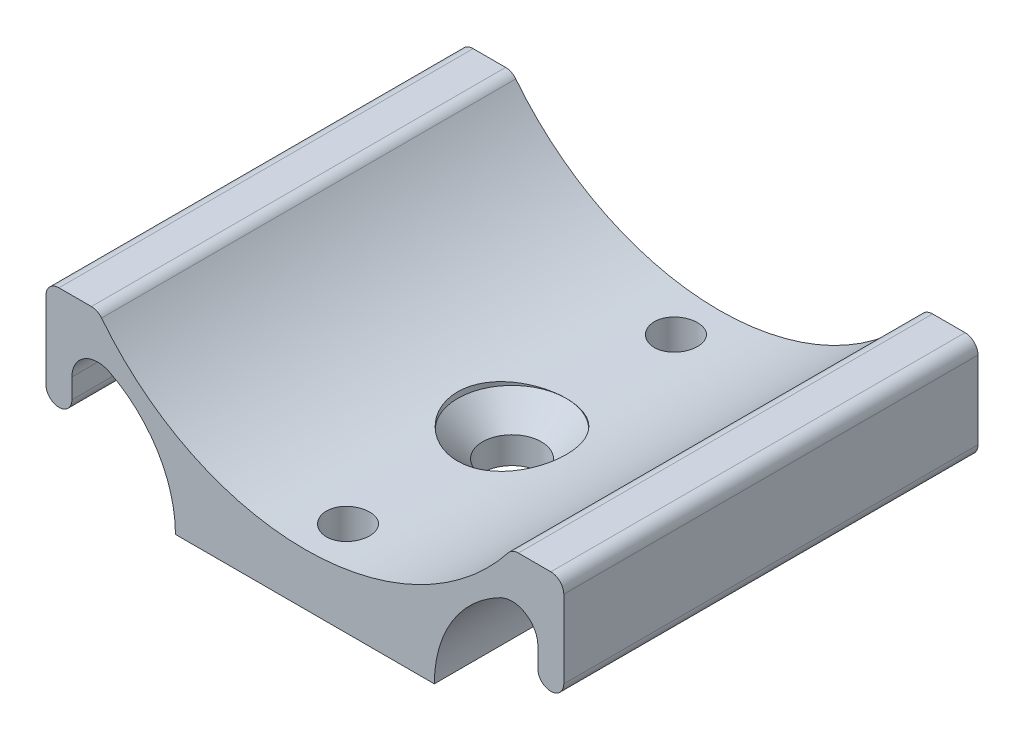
ISO-10303-21;
HEADER;
FILE_DESCRIPTION(('STEP AP214'),'2;1');
FILE_NAME('part.step','',(''),(''),'','','');
FILE_SCHEMA(('AUTOMOTIVE_DESIGN { 1 0 10303 214 1 1 1 1 }'));
ENDSEC;
DATA;
#1=APPLICATION_CONTEXT('core data for automotive mechanical design processes');
#2=APPLICATION_PROTOCOL_DEFINITION('international standard','automotive_design',2000,#1);
#3=PRODUCT_CONTEXT('',#1,'mechanical');
#4=PRODUCT('Part','Part','',(#3));
#5=PRODUCT_RELATED_PRODUCT_CATEGORY('part','',(#4));
#6=PRODUCT_DEFINITION_FORMATION('','',#4);
#7=PRODUCT_DEFINITION_CONTEXT('part definition',#1,'design');
#8=PRODUCT_DEFINITION('design','',#6,#7);
#9=PRODUCT_DEFINITION_SHAPE('','',#8);
#10=(LENGTH_UNIT() NAMED_UNIT(*) SI_UNIT(.MILLI.,.METRE.));
#11=(NAMED_UNIT(*) PLANE_ANGLE_UNIT() SI_UNIT($,.RADIAN.));
#12=(NAMED_UNIT(*) SI_UNIT($,.STERADIAN.) SOLID_ANGLE_UNIT());
#13=UNCERTAINTY_MEASURE_WITH_UNIT(LENGTH_MEASURE(1.E-05),#10,'distance_accuracy_value','');
#14=(GEOMETRIC_REPRESENTATION_CONTEXT(3) GLOBAL_UNCERTAINTY_ASSIGNED_CONTEXT((#13)) GLOBAL_UNIT_ASSIGNED_CONTEXT((#10,
#11,#12)) REPRESENTATION_CONTEXT('',''));
#15=CARTESIAN_POINT('',(0.,0.,0.));
#16=DIRECTION('',(0.,0.,1.));
#17=DIRECTION('',(1.,0.,0.));
#18=AXIS2_PLACEMENT_3D('',#15,#16,#17);
#19=CARTESIAN_POINT('',(14.25,0.75,24.));
#20=DIRECTION('',(0.,0.,-1.));
#21=DIRECTION('',(-1.,0.,0.));
#22=AXIS2_PLACEMENT_3D('',#19,#20,#21);
#23=CYLINDRICAL_SURFACE('',#22,0.750000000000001);
#24=CARTESIAN_POINT('',(14.25,0.75,24.));
#25=DIRECTION('',(0.,0.,-1.));
#26=DIRECTION('',(-1.,0.,0.));
#27=AXIS2_PLACEMENT_3D('',#24,#25,#26);
#28=CIRCLE('',#27,0.750000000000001);
#29=CARTESIAN_POINT('',(13.5,0.75,24.));
#30=VERTEX_POINT('',#29);
#31=CARTESIAN_POINT('',(15.,0.75,24.));
#32=VERTEX_POINT('',#31);
#33=EDGE_CURVE('E401',#30,#32,#28,.F.);
#34=ORIENTED_EDGE('',*,*,#33,.F.);
#35=DIRECTION('',(0.,0.,1.));
#36=VECTOR('',#35,1.);
#37=CARTESIAN_POINT('',(13.5,0.75,12.));
#38=LINE('',#37,#36);
#39=CARTESIAN_POINT('',(13.5,0.75,0.));
#40=VERTEX_POINT('',#39);
#41=EDGE_CURVE('E180',#40,#30,#38,.T.);
#42=ORIENTED_EDGE('',*,*,#41,.F.);
#43=CARTESIAN_POINT('',(14.25,0.75,0.));
#44=DIRECTION('',(0.,0.,-1.));
#45=DIRECTION('',(-1.,0.,0.));
#46=AXIS2_PLACEMENT_3D('',#43,#44,#45);
#47=CIRCLE('',#46,0.750000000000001);
#48=CARTESIAN_POINT('',(15.,0.75,0.));
#49=VERTEX_POINT('',#48);
#50=EDGE_CURVE('E20',#49,#40,#47,.T.);
#51=ORIENTED_EDGE('',*,*,#50,.F.);
#52=DIRECTION('',(0.,0.,-1.));
#53=VECTOR('',#52,1.);
#54=CARTESIAN_POINT('',(15.,0.75,12.));
#55=LINE('',#54,#53);
#56=EDGE_CURVE('E388',#32,#49,#55,.T.);
#57=ORIENTED_EDGE('',*,*,#56,.F.);
#58=EDGE_LOOP('',(#34,#42,#51,#57));
#59=FACE_BOUND('',#58,.T.);
#60=ADVANCED_FACE('F16',(#59),#23,.T.);
#61=CARTESIAN_POINT('',(-14.25,5.25,0.));
#62=DIRECTION('',(0.,0.,1.));
#63=DIRECTION('',(1.,0.,0.));
#64=AXIS2_PLACEMENT_3D('',#61,#62,#63);
#65=CYLINDRICAL_SURFACE('',#64,0.750000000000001);
#66=DIRECTION('',(0.,0.,1.));
#67=VECTOR('',#66,1.);
#68=CARTESIAN_POINT('',(-14.25,6.,12.));
#69=LINE('',#68,#67);
#70=CARTESIAN_POINT('',(-14.25,6.,0.));
#71=VERTEX_POINT('',#70);
#72=CARTESIAN_POINT('',(-14.25,6.,24.));
#73=VERTEX_POINT('',#72);
#74=EDGE_CURVE('E377',#71,#73,#69,.T.);
#75=ORIENTED_EDGE('',*,*,#74,.F.);
#76=CARTESIAN_POINT('',(-14.25,5.25,0.));
#77=DIRECTION('',(0.,0.,1.));
#78=DIRECTION('',(1.,0.,0.));
#79=AXIS2_PLACEMENT_3D('',#76,#77,#78);
#80=CIRCLE('',#79,0.750000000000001);
#81=CARTESIAN_POINT('',(-15.,5.25,0.));
#82=VERTEX_POINT('',#81);
#83=EDGE_CURVE('E403',#82,#71,#80,.F.);
#84=ORIENTED_EDGE('',*,*,#83,.F.);
#85=DIRECTION('',(0.,0.,1.));
#86=VECTOR('',#85,1.);
#87=CARTESIAN_POINT('',(-15.,5.25,12.));
#88=LINE('',#87,#86);
#89=CARTESIAN_POINT('',(-15.,5.25,24.));
#90=VERTEX_POINT('',#89);
#91=EDGE_CURVE('E374',#82,#90,#88,.T.);
#92=ORIENTED_EDGE('',*,*,#91,.T.);
#93=CARTESIAN_POINT('',(-14.25,5.25,24.));
#94=DIRECTION('',(0.,0.,1.));
#95=DIRECTION('',(1.,0.,0.));
#96=AXIS2_PLACEMENT_3D('',#93,#94,#95);
#97=CIRCLE('',#96,0.750000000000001);
#98=EDGE_CURVE('E160',#73,#90,#97,.T.);
#99=ORIENTED_EDGE('',*,*,#98,.F.);
#100=EDGE_LOOP('',(#75,#84,#92,#99));
#101=FACE_BOUND('',#100,.T.);
#102=ADVANCED_FACE('F268',(#101),#65,.T.);
#103=CARTESIAN_POINT('',(-14.25,0.75,24.));
#104=DIRECTION('',(0.,0.,-1.));
#105=DIRECTION('',(-1.,0.,0.));
#106=AXIS2_PLACEMENT_3D('',#103,#104,#105);
#107=CYLINDRICAL_SURFACE('',#106,0.749999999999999);
#108=CARTESIAN_POINT('',(-14.25,0.75,24.));
#109=DIRECTION('',(0.,0.,-1.));
#110=DIRECTION('',(-1.,0.,0.));
#111=AXIS2_PLACEMENT_3D('',#108,#109,#110);
#112=CIRCLE('',#111,0.749999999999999);
#113=CARTESIAN_POINT('',(-15.,0.75,24.));
#114=VERTEX_POINT('',#113);
#115=CARTESIAN_POINT('',(-13.5,0.75,24.));
#116=VERTEX_POINT('',#115);
#117=EDGE_CURVE('E144',#114,#116,#112,.F.);
#118=ORIENTED_EDGE('',*,*,#117,.F.);
#119=DIRECTION('',(0.,0.,-1.));
#120=VECTOR('',#119,1.);
#121=CARTESIAN_POINT('',(-15.,0.75,12.));
#122=LINE('',#121,#120);
#123=CARTESIAN_POINT('',(-15.,0.75,0.));
#124=VERTEX_POINT('',#123);
#125=EDGE_CURVE('E155',#114,#124,#122,.T.);
#126=ORIENTED_EDGE('',*,*,#125,.T.);
#127=CARTESIAN_POINT('',(-14.25,0.75,0.));
#128=DIRECTION('',(0.,0.,-1.));
#129=DIRECTION('',(-1.,0.,0.));
#130=AXIS2_PLACEMENT_3D('',#127,#128,#129);
#131=CIRCLE('',#130,0.749999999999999);
#132=CARTESIAN_POINT('',(-13.5,0.75,0.));
#133=VERTEX_POINT('',#132);
#134=EDGE_CURVE('E150',#133,#124,#131,.T.);
#135=ORIENTED_EDGE('',*,*,#134,.F.);
#136=DIRECTION('',(0.,0.,1.));
#137=VECTOR('',#136,1.);
#138=CARTESIAN_POINT('',(-13.5,0.75,12.));
#139=LINE('',#138,#137);
#140=EDGE_CURVE('E153',#133,#116,#139,.T.);
#141=ORIENTED_EDGE('',*,*,#140,.T.);
#142=EDGE_LOOP('',(#118,#126,#135,#141));
#143=FACE_BOUND('',#142,.T.);
#144=ADVANCED_FACE('F152',(#143),#107,.T.);
#145=CARTESIAN_POINT('',(-13.5,0.75,0.));
#146=DIRECTION('',(-1.,0.,0.));
#147=DIRECTION('',(0.,0.,1.));
#148=AXIS2_PLACEMENT_3D('',#145,#146,#147);
#149=PLANE('',#148);
#150=DIRECTION('',(0.,0.,1.));
#151=VECTOR('',#150,1.);
#152=CARTESIAN_POINT('',(-13.5,1.898979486,12.));
#153=LINE('',#152,#151);
#154=CARTESIAN_POINT('',(-13.5,1.898979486,24.));
#155=VERTEX_POINT('',#154);
#156=CARTESIAN_POINT('',(-13.5,1.898979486,0.));
#157=VERTEX_POINT('',#156);
#158=EDGE_CURVE('E369',#155,#157,#153,.F.);
#159=ORIENTED_EDGE('',*,*,#158,.F.);
#160=DIRECTION('',(0.,1.,0.));
#161=VECTOR('',#160,1.);
#162=CARTESIAN_POINT('',(-13.5,1.324489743,24.));
#163=LINE('',#162,#161);
#164=EDGE_CURVE('E167',#116,#155,#163,.T.);
#165=ORIENTED_EDGE('',*,*,#164,.F.);
#166=ORIENTED_EDGE('',*,*,#140,.F.);
#167=DIRECTION('',(0.,-1.,0.));
#168=VECTOR('',#167,1.);
#169=CARTESIAN_POINT('',(-13.5,1.324489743,0.));
#170=LINE('',#169,#168);
#171=EDGE_CURVE('E165',#157,#133,#170,.T.);
#172=ORIENTED_EDGE('',*,*,#171,.F.);
#173=EDGE_LOOP('',(#159,#165,#166,#172));
#174=FACE_BOUND('',#173,.T.);
#175=ADVANCED_FACE('F164',(#174),#149,.F.);
#176=CARTESIAN_POINT('',(13.5,0.75,0.));
#177=DIRECTION('',(-1.,0.,0.));
#178=DIRECTION('',(0.,0.,1.));
#179=AXIS2_PLACEMENT_3D('',#176,#177,#178);
#180=PLANE('',#179);
#181=DIRECTION('',(0.,-1.,0.));
#182=VECTOR('',#181,1.);
#183=CARTESIAN_POINT('',(13.5,1.324489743,0.));
#184=LINE('',#183,#182);
#185=CARTESIAN_POINT('',(13.5,1.89897948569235,0.));
#186=VERTEX_POINT('',#185);
#187=EDGE_CURVE('E176',#186,#40,#184,.T.);
#188=ORIENTED_EDGE('',*,*,#187,.T.);
#189=ORIENTED_EDGE('',*,*,#41,.T.);
#190=DIRECTION('',(0.,1.,0.));
#191=VECTOR('',#190,1.);
#192=CARTESIAN_POINT('',(13.5,1.324489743,24.));
#193=LINE('',#192,#191);
#194=CARTESIAN_POINT('',(13.5,1.89897948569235,24.));
#195=VERTEX_POINT('',#194);
#196=EDGE_CURVE('E174',#30,#195,#193,.T.);
#197=ORIENTED_EDGE('',*,*,#196,.T.);
#198=DIRECTION('',(0.,0.,-1.));
#199=VECTOR('',#198,1.);
#200=CARTESIAN_POINT('',(13.5,1.89897948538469,12.));
#201=LINE('',#200,#199);
#202=EDGE_CURVE('E365',#186,#195,#201,.F.);
#203=ORIENTED_EDGE('',*,*,#202,.F.);
#204=EDGE_LOOP('',(#188,#189,#197,#203));
#205=FACE_BOUND('',#204,.T.);
#206=ADVANCED_FACE('F264',(#205),#180,.T.);
#207=CARTESIAN_POINT('',(14.25,5.25,24.));
#208=DIRECTION('',(0.,0.,-1.));
#209=DIRECTION('',(-1.,0.,0.));
#210=AXIS2_PLACEMENT_3D('',#207,#208,#209);
#211=CYLINDRICAL_SURFACE('',#210,0.750000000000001);
#212=DIRECTION('',(0.,0.,1.));
#213=VECTOR('',#212,1.);
#214=CARTESIAN_POINT('',(15.,5.25,12.));
#215=LINE('',#214,#213);
#216=CARTESIAN_POINT('',(15.,5.25,0.));
#217=VERTEX_POINT('',#216);
#218=CARTESIAN_POINT('',(15.,5.25,24.));
#219=VERTEX_POINT('',#218);
#220=EDGE_CURVE('E381',#217,#219,#215,.T.);
#221=ORIENTED_EDGE('',*,*,#220,.F.);
#222=CARTESIAN_POINT('',(14.25,5.25,0.));
#223=DIRECTION('',(0.,0.,-1.));
#224=DIRECTION('',(-1.,0.,0.));
#225=AXIS2_PLACEMENT_3D('',#222,#223,#224);
#226=CIRCLE('',#225,0.750000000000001);
#227=CARTESIAN_POINT('',(14.25,6.,0.));
#228=VERTEX_POINT('',#227);
#229=EDGE_CURVE('E182',#228,#217,#226,.T.);
#230=ORIENTED_EDGE('',*,*,#229,.F.);
#231=DIRECTION('',(0.,0.,-1.));
#232=VECTOR('',#231,1.);
#233=CARTESIAN_POINT('',(14.25,6.,12.));
#234=LINE('',#233,#232);
#235=CARTESIAN_POINT('',(14.25,6.,24.));
#236=VERTEX_POINT('',#235);
#237=EDGE_CURVE('E368',#236,#228,#234,.T.);
#238=ORIENTED_EDGE('',*,*,#237,.F.);
#239=CARTESIAN_POINT('',(14.25,5.25,24.));
#240=DIRECTION('',(0.,0.,-1.));
#241=DIRECTION('',(-1.,0.,0.));
#242=AXIS2_PLACEMENT_3D('',#239,#240,#241);
#243=CIRCLE('',#242,0.750000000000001);
#244=EDGE_CURVE('E391',#219,#236,#243,.F.);
#245=ORIENTED_EDGE('',*,*,#244,.F.);
#246=EDGE_LOOP('',(#221,#230,#238,#245));
#247=FACE_BOUND('',#246,.T.);
#248=ADVANCED_FACE('F260',(#247),#211,.T.);
#249=CARTESIAN_POINT('',(15.,0.75,24.));
#250=DIRECTION('',(1.,0.,0.));
#251=DIRECTION('',(0.,0.,-1.));
#252=AXIS2_PLACEMENT_3D('',#249,#250,#251);
#253=PLANE('',#252);
#254=DIRECTION('',(0.,1.,0.));
#255=VECTOR('',#254,1.);
#256=CARTESIAN_POINT('',(15.,1.5,0.));
#257=LINE('',#256,#255);
#258=EDGE_CURVE('E343',#49,#217,#257,.T.);
#259=ORIENTED_EDGE('',*,*,#258,.T.);
#260=ORIENTED_EDGE('',*,*,#220,.T.);
#261=DIRECTION('',(0.,1.,0.));
#262=VECTOR('',#261,1.);
#263=CARTESIAN_POINT('',(15.,1.5,24.));
#264=LINE('',#263,#262);
#265=EDGE_CURVE('E329',#32,#219,#264,.T.);
#266=ORIENTED_EDGE('',*,*,#265,.F.);
#267=ORIENTED_EDGE('',*,*,#56,.T.);
#268=EDGE_LOOP('',(#259,#260,#266,#267));
#269=FACE_BOUND('',#268,.T.);
#270=ADVANCED_FACE('F263',(#269),#253,.T.);
#271=CARTESIAN_POINT('',(-14.25,6.,0.));
#272=DIRECTION('',(0.,1.,0.));
#273=DIRECTION('',(0.,0.,1.));
#274=AXIS2_PLACEMENT_3D('',#271,#272,#273);
#275=PLANE('',#274);
#276=DIRECTION('',(-1.,0.,0.));
#277=VECTOR('',#276,1.);
#278=CARTESIAN_POINT('',(0.,6.,0.));
#279=LINE('',#278,#277);
#280=CARTESIAN_POINT('',(-12.3693168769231,6.,0.));
#281=VERTEX_POINT('',#280);
#282=EDGE_CURVE('E338',#281,#71,#279,.T.);
#283=ORIENTED_EDGE('',*,*,#282,.T.);
#284=ORIENTED_EDGE('',*,*,#74,.T.);
#285=DIRECTION('',(-1.,0.,0.));
#286=VECTOR('',#285,1.);
#287=CARTESIAN_POINT('',(0.,6.,24.));
#288=LINE('',#287,#286);
#289=CARTESIAN_POINT('',(-12.3693168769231,6.,24.));
#290=VERTEX_POINT('',#289);
#291=EDGE_CURVE('E323',#290,#73,#288,.T.);
#292=ORIENTED_EDGE('',*,*,#291,.F.);
#293=DIRECTION('',(0.,0.,1.));
#294=VECTOR('',#293,1.);
#295=CARTESIAN_POINT('',(-12.3693168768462,6.,12.));
#296=LINE('',#295,#294);
#297=EDGE_CURVE('E382',#290,#281,#296,.F.);
#298=ORIENTED_EDGE('',*,*,#297,.T.);
#299=EDGE_LOOP('',(#283,#284,#292,#298));
#300=FACE_BOUND('',#299,.T.);
#301=ADVANCED_FACE('F282',(#300),#275,.T.);
#302=CARTESIAN_POINT('',(-15.,0.75,24.));
#303=DIRECTION('',(1.,0.,0.));
#304=DIRECTION('',(0.,0.,-1.));
#305=AXIS2_PLACEMENT_3D('',#302,#303,#304);
#306=PLANE('',#305);
#307=ORIENTED_EDGE('',*,*,#125,.F.);
#308=DIRECTION('',(0.,-1.,0.));
#309=VECTOR('',#308,1.);
#310=CARTESIAN_POINT('',(-15.,1.5,24.));
#311=LINE('',#310,#309);
#312=EDGE_CURVE('E320',#90,#114,#311,.T.);
#313=ORIENTED_EDGE('',*,*,#312,.F.);
#314=ORIENTED_EDGE('',*,*,#91,.F.);
#315=DIRECTION('',(0.,-1.,0.));
#316=VECTOR('',#315,1.);
#317=CARTESIAN_POINT('',(-15.,1.5,0.));
#318=LINE('',#317,#316);
#319=EDGE_CURVE('E336',#82,#124,#318,.T.);
#320=ORIENTED_EDGE('',*,*,#319,.T.);
#321=EDGE_LOOP('',(#307,#313,#314,#320));
#322=FACE_BOUND('',#321,.T.);
#323=ADVANCED_FACE('F258',(#322),#306,.F.);
#324=CARTESIAN_POINT('',(-12.,1.898979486,24.));
#325=DIRECTION('',(0.,0.,-1.));
#326=DIRECTION('',(-1.,0.,0.));
#327=AXIS2_PLACEMENT_3D('',#324,#325,#326);
#328=CYLINDRICAL_SURFACE('',#327,1.5);
#329=CARTESIAN_POINT('',(-12.,1.898979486,0.));
#330=DIRECTION('',(0.,0.,-1.));
#331=DIRECTION('',(-1.,0.,0.));
#332=AXIS2_PLACEMENT_3D('',#329,#330,#331);
#333=CIRCLE('',#332,1.5);
#334=CARTESIAN_POINT('',(-11.3181818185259,3.23506479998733,0.));
#335=VERTEX_POINT('',#334);
#336=EDGE_CURVE('E173',#157,#335,#333,.T.);
#337=ORIENTED_EDGE('',*,*,#336,.T.);
#338=DIRECTION('',(0.,0.,1.));
#339=VECTOR('',#338,1.);
#340=CARTESIAN_POINT('',(-11.3181818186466,3.2350648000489,12.));
#341=LINE('',#340,#339);
#342=CARTESIAN_POINT('',(-11.3181818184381,3.23506480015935,24.));
#343=VERTEX_POINT('',#342);
#344=EDGE_CURVE('E371',#343,#335,#341,.F.);
#345=ORIENTED_EDGE('',*,*,#344,.F.);
#346=CARTESIAN_POINT('',(-12.,1.898979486,24.));
#347=DIRECTION('',(0.,0.,-1.));
#348=DIRECTION('',(-1.,0.,0.));
#349=AXIS2_PLACEMENT_3D('',#346,#347,#348);
#350=CIRCLE('',#349,1.5);
#351=EDGE_CURVE('E322',#155,#343,#350,.T.);
#352=ORIENTED_EDGE('',*,*,#351,.F.);
#353=ORIENTED_EDGE('',*,*,#158,.T.);
#354=EDGE_LOOP('',(#337,#345,#352,#353));
#355=FACE_BOUND('',#354,.T.);
#356=ADVANCED_FACE('F254',(#355),#328,.F.);
#357=CARTESIAN_POINT('',(12.,1.898979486,24.));
#358=DIRECTION('',(0.,0.,-1.));
#359=DIRECTION('',(-1.,0.,0.));
#360=AXIS2_PLACEMENT_3D('',#357,#358,#359);
#361=CYLINDRICAL_SURFACE('',#360,1.5);
#362=CARTESIAN_POINT('',(12.,1.898979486,0.));
#363=DIRECTION('',(0.,0.,-1.));
#364=DIRECTION('',(-1.,0.,0.));
#365=AXIS2_PLACEMENT_3D('',#362,#363,#364);
#366=CIRCLE('',#365,1.5);
#367=CARTESIAN_POINT('',(11.318181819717,3.23506480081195,0.));
#368=VERTEX_POINT('',#367);
#369=EDGE_CURVE('E385',#368,#186,#366,.T.);
#370=ORIENTED_EDGE('',*,*,#369,.T.);
#371=ORIENTED_EDGE('',*,*,#202,.T.);
#372=CARTESIAN_POINT('',(12.,1.898979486,24.));
#373=DIRECTION('',(0.,0.,-1.));
#374=DIRECTION('',(-1.,0.,0.));
#375=AXIS2_PLACEMENT_3D('',#372,#373,#374);
#376=CIRCLE('',#375,1.5);
#377=CARTESIAN_POINT('',(11.3181818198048,3.23506480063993,24.));
#378=VERTEX_POINT('',#377);
#379=EDGE_CURVE('E427',#378,#195,#376,.T.);
#380=ORIENTED_EDGE('',*,*,#379,.F.);
#381=DIRECTION('',(0.,0.,-1.));
#382=VECTOR('',#381,1.);
#383=CARTESIAN_POINT('',(11.3181818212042,3.2350648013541,12.));
#384=LINE('',#383,#382);
#385=EDGE_CURVE('E346',#368,#378,#384,.F.);
#386=ORIENTED_EDGE('',*,*,#385,.F.);
#387=EDGE_LOOP('',(#370,#371,#380,#386));
#388=FACE_BOUND('',#387,.T.);
#389=ADVANCED_FACE('F251',(#388),#361,.F.);
#390=CARTESIAN_POINT('',(12.369316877,6.,0.));
#391=DIRECTION('',(0.,1.,0.));
#392=DIRECTION('',(0.,0.,1.));
#393=AXIS2_PLACEMENT_3D('',#390,#391,#392);
#394=PLANE('',#393);
#395=DIRECTION('',(-1.,0.,0.));
#396=VECTOR('',#395,1.);
#397=CARTESIAN_POINT('',(0.,6.,0.));
#398=LINE('',#397,#396);
#399=CARTESIAN_POINT('',(12.3693168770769,6.,0.));
#400=VERTEX_POINT('',#399);
#401=EDGE_CURVE('E341',#228,#400,#398,.T.);
#402=ORIENTED_EDGE('',*,*,#401,.T.);
#403=DIRECTION('',(0.,0.,-1.));
#404=VECTOR('',#403,1.);
#405=CARTESIAN_POINT('',(12.3693168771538,6.,12.));
#406=LINE('',#405,#404);
#407=CARTESIAN_POINT('',(12.3693168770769,6.,24.));
#408=VERTEX_POINT('',#407);
#409=EDGE_CURVE('E361',#400,#408,#406,.F.);
#410=ORIENTED_EDGE('',*,*,#409,.T.);
#411=DIRECTION('',(-1.,0.,0.));
#412=VECTOR('',#411,1.);
#413=CARTESIAN_POINT('',(0.,6.,24.));
#414=LINE('',#413,#412);
#415=EDGE_CURVE('E327',#236,#408,#414,.T.);
#416=ORIENTED_EDGE('',*,*,#415,.F.);
#417=ORIENTED_EDGE('',*,*,#237,.T.);
#418=EDGE_LOOP('',(#402,#410,#416,#417));
#419=FACE_BOUND('',#418,.T.);
#420=ADVANCED_FACE('F249',(#419),#394,.T.);
#421=CARTESIAN_POINT('',(-14.5,-3.,24.));
#422=DIRECTION('',(0.,0.,-1.));
#423=DIRECTION('',(-1.,0.,0.));
#424=AXIS2_PLACEMENT_3D('',#421,#422,#423);
#425=CYLINDRICAL_SURFACE('',#424,7.);
#426=CARTESIAN_POINT('',(-14.5,-3.,0.));
#427=DIRECTION('',(0.,0.,-1.));
#428=DIRECTION('',(-1.,0.,0.));
#429=AXIS2_PLACEMENT_3D('',#426,#427,#428);
#430=CIRCLE('',#429,7.);
#431=CARTESIAN_POINT('',(-7.5,-3.,0.));
#432=VERTEX_POINT('',#431);
#433=EDGE_CURVE('E411',#335,#432,#430,.T.);
#434=ORIENTED_EDGE('',*,*,#433,.T.);
#435=DIRECTION('',(0.,0.,1.));
#436=VECTOR('',#435,1.);
#437=CARTESIAN_POINT('',(-7.5,-3.,12.));
#438=LINE('',#437,#436);
#439=CARTESIAN_POINT('',(-7.5,-3.,24.));
#440=VERTEX_POINT('',#439);
#441=EDGE_CURVE('E355',#432,#440,#438,.T.);
#442=ORIENTED_EDGE('',*,*,#441,.T.);
#443=CARTESIAN_POINT('',(-14.5,-3.,24.));
#444=DIRECTION('',(0.,0.,-1.));
#445=DIRECTION('',(-1.,0.,0.));
#446=AXIS2_PLACEMENT_3D('',#443,#444,#445);
#447=CIRCLE('',#446,7.);
#448=EDGE_CURVE('E423',#343,#440,#447,.T.);
#449=ORIENTED_EDGE('',*,*,#448,.F.);
#450=ORIENTED_EDGE('',*,*,#344,.T.);
#451=EDGE_LOOP('',(#434,#442,#449,#450));
#452=FACE_BOUND('',#451,.T.);
#453=ADVANCED_FACE('F245',(#452),#425,.F.);
#454=CARTESIAN_POINT('',(14.5,-3.,24.));
#455=DIRECTION('',(0.,0.,-1.));
#456=DIRECTION('',(-1.,0.,0.));
#457=AXIS2_PLACEMENT_3D('',#454,#455,#456);
#458=CYLINDRICAL_SURFACE('',#457,7.);
#459=CARTESIAN_POINT('',(14.5,-3.,24.));
#460=DIRECTION('',(0.,0.,-1.));
#461=DIRECTION('',(-1.,0.,0.));
#462=AXIS2_PLACEMENT_3D('',#459,#460,#461);
#463=CIRCLE('',#462,7.);
#464=CARTESIAN_POINT('',(7.5,-3.,24.));
#465=VERTEX_POINT('',#464);
#466=EDGE_CURVE('E425',#465,#378,#463,.T.);
#467=ORIENTED_EDGE('',*,*,#466,.F.);
#468=DIRECTION('',(0.,0.,-1.));
#469=VECTOR('',#468,1.);
#470=CARTESIAN_POINT('',(7.5,-3.,12.));
#471=LINE('',#470,#469);
#472=CARTESIAN_POINT('',(7.5,-3.,0.));
#473=VERTEX_POINT('',#472);
#474=EDGE_CURVE('E347',#465,#473,#471,.T.);
#475=ORIENTED_EDGE('',*,*,#474,.T.);
#476=CARTESIAN_POINT('',(14.5,-3.,0.));
#477=DIRECTION('',(0.,0.,-1.));
#478=DIRECTION('',(-1.,0.,0.));
#479=AXIS2_PLACEMENT_3D('',#476,#477,#478);
#480=CIRCLE('',#479,7.);
#481=EDGE_CURVE('E414',#473,#368,#480,.T.);
#482=ORIENTED_EDGE('',*,*,#481,.T.);
#483=ORIENTED_EDGE('',*,*,#385,.T.);
#484=EDGE_LOOP('',(#467,#475,#482,#483));
#485=FACE_BOUND('',#484,.T.);
#486=ADVANCED_FACE('F241',(#485),#458,.F.);
#487=CARTESIAN_POINT('',(0.,0.0704948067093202,21.5));
#488=DIRECTION('',(0.,-1.,0.));
#489=DIRECTION('',(0.,0.,-1.));
#490=AXIS2_PLACEMENT_3D('',#487,#488,#489);
#491=CYLINDRICAL_SURFACE('',#490,1.25);
#492=CARTESIAN_POINT('',(3.46220824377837E-09,0.,20.25));
#493=CARTESIAN_POINT('',(0.0700217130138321,6.42643320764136E-07,20.2500029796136));
#494=CARTESIAN_POINT('',(0.140136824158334,0.000495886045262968,20.255907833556));
#495=CARTESIAN_POINT('',(0.278473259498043,0.00242482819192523,20.2793881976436));
#496=CARTESIAN_POINT('',(0.346690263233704,0.00386051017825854,20.2969883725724));
#497=CARTESIAN_POINT('',(0.479138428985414,0.0075081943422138,20.3433491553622));
#498=CARTESIAN_POINT('',(0.543373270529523,0.00971946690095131,20.3720992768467));
#499=CARTESIAN_POINT('',(0.666073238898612,0.0146697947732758,20.4399246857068));
#500=CARTESIAN_POINT('',(0.724540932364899,0.0174086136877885,20.4789953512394));
#501=CARTESIAN_POINT('',(0.834236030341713,0.0231151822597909,20.5664677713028));
#502=CARTESIAN_POINT('',(0.885446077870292,0.0260834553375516,20.6148912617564));
#503=CARTESIAN_POINT('',(0.979024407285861,0.0319101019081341,20.7196509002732));
#504=CARTESIAN_POINT('',(1.02139187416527,0.0347684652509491,20.7759877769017));
#505=CARTESIAN_POINT('',(1.09613505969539,0.0400568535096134,20.8950729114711));
#506=CARTESIAN_POINT('',(1.12849632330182,0.0424862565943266,20.9578302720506));
#507=CARTESIAN_POINT('',(1.18221573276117,0.0466359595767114,21.0879109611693));
#508=CARTESIAN_POINT('',(1.20357416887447,0.0483562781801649,21.155234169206));
#509=CARTESIAN_POINT('',(1.23463377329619,0.0508888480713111,21.2923691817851));
#510=CARTESIAN_POINT('',(1.24436206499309,0.0517032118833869,21.3621748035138));
#511=CARTESIAN_POINT('',(1.25196901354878,0.052338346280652,21.5024326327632));
#512=CARTESIAN_POINT('',(1.24984787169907,0.052159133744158,21.57288482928));
#513=CARTESIAN_POINT('',(1.2338386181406,0.0508292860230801,21.7122492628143));
#514=CARTESIAN_POINT('',(1.21998009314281,0.0496810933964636,21.7811649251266));
#515=CARTESIAN_POINT('',(1.1809352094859,0.0465464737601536,21.9156892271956));
#516=CARTESIAN_POINT('',(1.15574863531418,0.0445600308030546,21.9812978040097));
#517=CARTESIAN_POINT('',(1.09472847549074,0.0399698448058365,22.1074412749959));
#518=CARTESIAN_POINT('',(1.05888124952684,0.0373653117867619,22.1679695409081));
#519=CARTESIAN_POINT('',(0.977570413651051,0.0318334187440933,22.2821561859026));
#520=CARTESIAN_POINT('',(0.932107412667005,0.0289060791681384,22.335814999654));
#521=CARTESIAN_POINT('',(0.832698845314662,0.0230479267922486,22.434907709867));
#522=CARTESIAN_POINT('',(0.778729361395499,0.0201171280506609,22.4803176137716));
#523=CARTESIAN_POINT('',(0.663890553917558,0.0145888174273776,22.5614580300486));
#524=CARTESIAN_POINT('',(0.603018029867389,0.0119914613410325,22.5971840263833));
#525=CARTESIAN_POINT('',(0.476069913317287,0.00742199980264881,22.6579366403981));
#526=CARTESIAN_POINT('',(0.409989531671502,0.00545047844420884,22.6829532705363));
#527=CARTESIAN_POINT('',(0.274637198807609,0.00236243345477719,22.7214772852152));
#528=CARTESIAN_POINT('',(0.205372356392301,0.00124409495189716,22.7350091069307));
#529=CARTESIAN_POINT('',(0.113043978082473,0.000408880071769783,22.7450848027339));
#530=CARTESIAN_POINT('',(0.090477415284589,0.000255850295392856,22.7469266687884));
#531=CARTESIAN_POINT('',(0.0452771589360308,5.13063506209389E-05,22.7493847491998));
#532=CARTESIAN_POINT('',(0.022643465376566,-2.07804480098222E-07,22.7500009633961));
#533=CARTESIAN_POINT('',(-0.0700217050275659,6.4260604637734E-07,22.7499970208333));
#534=CARTESIAN_POINT('',(-0.140136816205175,0.000495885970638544,22.7440921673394));
#535=CARTESIAN_POINT('',(-0.278473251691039,0.00242482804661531,22.7206118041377));
#536=CARTESIAN_POINT('',(-0.346690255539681,0.00386050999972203,22.703011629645));
#537=CARTESIAN_POINT('',(-0.479138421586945,0.00750819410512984,22.6566508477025));
#538=CARTESIAN_POINT('',(-0.543373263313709,0.00971946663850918,22.6279007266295));
#539=CARTESIAN_POINT('',(-0.666073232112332,0.0146697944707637,22.560075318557));
#540=CARTESIAN_POINT('',(-0.724540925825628,0.0174086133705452,22.5210046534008));
#541=CARTESIAN_POINT('',(-0.83423602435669,0.0231151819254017,22.4335322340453));
#542=CARTESIAN_POINT('',(-0.885446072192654,0.0260834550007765,22.385108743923));
#543=CARTESIAN_POINT('',(-0.979024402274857,0.0319101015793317,22.2803491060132));
#544=CARTESIAN_POINT('',(-1.02139186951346,0.0347684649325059,22.2240122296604));
#545=CARTESIAN_POINT('',(-1.09613505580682,0.0400568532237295,22.1049270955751));
#546=CARTESIAN_POINT('',(-1.12849631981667,0.0424862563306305,22.0421697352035));
#547=CARTESIAN_POINT('',(-1.18221573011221,0.0466359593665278,21.9120890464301));
#548=CARTESIAN_POINT('',(-1.20357416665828,0.0483562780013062,21.8447658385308));
#549=CARTESIAN_POINT('',(-1.2346337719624,0.0508888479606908,21.7076308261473));
#550=CARTESIAN_POINT('',(-1.24436206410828,0.0517032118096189,21.637825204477));
#551=CARTESIAN_POINT('',(-1.25196901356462,0.0523383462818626,21.4975673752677));
#552=CARTESIAN_POINT('',(-1.2498478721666,0.0521591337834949,21.4271151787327));
#553=CARTESIAN_POINT('',(-1.23383861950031,0.0508292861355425,21.2877507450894));
#554=CARTESIAN_POINT('',(-1.21998009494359,0.0496810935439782,21.2188350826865));
#555=CARTESIAN_POINT('',(-1.18093521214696,0.046546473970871,21.0843107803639));
#556=CARTESIAN_POINT('',(-1.15574863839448,0.0445600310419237,21.0187022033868));
#557=CARTESIAN_POINT('',(-1.09472847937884,0.0399698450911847,20.8925587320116));
#558=CARTESIAN_POINT('',(-1.05888125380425,0.0373653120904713,20.832030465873));
#559=CARTESIAN_POINT('',(-0.977570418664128,0.0318334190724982,20.7178438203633));
#560=CARTESIAN_POINT('',(-0.932107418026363,0.0289060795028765,20.6641850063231));
#561=CARTESIAN_POINT('',(-0.83269885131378,0.0230479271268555,20.5650922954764));
#562=CARTESIAN_POINT('',(-0.77872936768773,0.0201171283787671,20.5196823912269));
#563=CARTESIAN_POINT('',(-0.663890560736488,0.0145888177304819,20.4385419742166));
#564=CARTESIAN_POINT('',(-0.60301803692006,0.011991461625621,20.4028159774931));
#565=CARTESIAN_POINT('',(-0.476069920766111,0.00742200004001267,20.3420633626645));
#566=CARTESIAN_POINT('',(-0.409989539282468,0.00545047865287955,20.3170467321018));
#567=CARTESIAN_POINT('',(-0.274637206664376,0.00236243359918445,20.278522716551));
#568=CARTESIAN_POINT('',(-0.205372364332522,0.00124409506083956,20.2649908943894));
#569=CARTESIAN_POINT('',(-0.113043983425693,0.000408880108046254,20.2549151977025));
#570=CARTESIAN_POINT('',(-0.090477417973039,0.000255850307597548,20.2530733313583));
#571=CARTESIAN_POINT('',(-0.0452771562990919,5.1306338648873E-05,20.2506152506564));
#572=CARTESIAN_POINT('',(-0.0226434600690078,-2.07816557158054E-07,20.2499990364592));
#573=CARTESIAN_POINT('',(3.46220824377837E-09,0.,20.25));
#574=B_SPLINE_CURVE_WITH_KNOTS('',3,(#492,#493,#494,#495,#496,#497,#498,#499,#500,#501,#502,
#503,#504,#505,#506,#507,#508,#509,#510,#511,#512,#513,#514,#515,#516,#517,#518,#519,#520,#521,
#522,#523,#524,#525,#526,#527,#528,#529,#530,#531,#532,#533,#534,#535,#536,#537,#538,#539,#540,
#541,#542,#543,#544,#545,#546,#547,#548,#549,#550,#551,#552,#553,#554,#555,#556,#557,#558,#559,
#560,#561,#562,#563,#564,#565,#566,#567,#568,#569,#570,#571,#572,#573),.UNSPECIFIED.,.T.,.F.,(4,
2,2,2,2,2,2,2,2,2,2,2,2,2,2,2,2,2,2,2,2,2,2,2,2,2,2,2,2,2,2,2,2,2,2,2,2,2,2,2,4),(0.,
0.209978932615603,0.42040211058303,0.630627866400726,0.840759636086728,1.05138575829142,
1.26203128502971,1.47297970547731,1.68392256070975,1.89437249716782,2.10481885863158,
2.31473631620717,2.5246577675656,2.73484897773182,2.94502688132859,3.15580664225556,
3.36668453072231,3.5777586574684,3.78838253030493,3.85628503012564,3.9241875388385,
4.13416647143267,4.3445896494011,4.55481540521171,4.76494717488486,4.97557329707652,
5.18621882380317,5.3971672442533,5.60811009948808,5.81856003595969,6.02900639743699,
6.2389238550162,6.4488453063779,6.6590365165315,6.86921442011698,7.07999418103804,
7.2908720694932,7.50194619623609,7.71257006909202,7.78047257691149,7.84837509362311),.UNSPECIFIED.);
#575=CARTESIAN_POINT('',(3.46220824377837E-09,0.,20.25));
#576=VERTEX_POINT('',#575);
#577=EDGE_CURVE('E210',#576,#576,#574,.T.);
#578=ORIENTED_EDGE('',*,*,#577,.F.);
#579=EDGE_LOOP('',(#578));
#580=FACE_BOUND('',#579,.T.);
#581=CARTESIAN_POINT('',(0.,-3.,21.5));
#582=DIRECTION('',(0.,-1.,0.));
#583=DIRECTION('',(0.,0.,-1.));
#584=AXIS2_PLACEMENT_3D('',#581,#582,#583);
#585=CIRCLE('',#584,1.25);
#586=CARTESIAN_POINT('',(0.,-3.,20.25));
#587=VERTEX_POINT('',#586);
#588=EDGE_CURVE('E435',#587,#587,#585,.T.);
#589=ORIENTED_EDGE('',*,*,#588,.T.);
#590=EDGE_LOOP('',(#589));
#591=FACE_BOUND('',#590,.T.);
#592=ADVANCED_FACE('F235',(#580,#591),#491,.F.);
#593=CARTESIAN_POINT('',(0.,0.0704948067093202,2.5));
#594=DIRECTION('',(0.,-1.,0.));
#595=DIRECTION('',(0.,0.,-1.));
#596=AXIS2_PLACEMENT_3D('',#593,#594,#595);
#597=CYLINDRICAL_SURFACE('',#596,1.25);
#598=CARTESIAN_POINT('',(3.46220823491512E-09,0.,1.25));
#599=CARTESIAN_POINT('',(0.0700217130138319,6.42643320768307E-07,1.25000297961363));
#600=CARTESIAN_POINT('',(0.140136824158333,0.000495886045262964,1.255907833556));
#601=CARTESIAN_POINT('',(0.278473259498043,0.00242482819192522,1.27938819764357));
#602=CARTESIAN_POINT('',(0.346690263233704,0.00386051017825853,1.29698837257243));
#603=CARTESIAN_POINT('',(0.479138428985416,0.00750819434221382,1.34334915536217));
#604=CARTESIAN_POINT('',(0.543373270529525,0.00971946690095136,1.37209927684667));
#605=CARTESIAN_POINT('',(0.666073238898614,0.0146697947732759,1.4399246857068));
#606=CARTESIAN_POINT('',(0.724540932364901,0.0174086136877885,1.47899535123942));
#607=CARTESIAN_POINT('',(0.834236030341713,0.0231151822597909,1.56646777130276));
#608=CARTESIAN_POINT('',(0.885446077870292,0.0260834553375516,1.6148912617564));
#609=CARTESIAN_POINT('',(0.979024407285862,0.0319101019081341,1.71965090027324));
#610=CARTESIAN_POINT('',(1.02139187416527,0.0347684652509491,1.77598777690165));
#611=CARTESIAN_POINT('',(1.0961350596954,0.0400568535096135,1.89507291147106));
#612=CARTESIAN_POINT('',(1.12849632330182,0.0424862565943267,1.9578302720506));
#613=CARTESIAN_POINT('',(1.18221573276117,0.0466359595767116,2.08791096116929));
#614=CARTESIAN_POINT('',(1.20357416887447,0.048356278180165,2.15523416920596));
#615=CARTESIAN_POINT('',(1.23463377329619,0.0508888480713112,2.2923691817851));
#616=CARTESIAN_POINT('',(1.24436206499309,0.051703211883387,2.36217480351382));
#617=CARTESIAN_POINT('',(1.25196901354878,0.0523383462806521,2.50243263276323));
#618=CARTESIAN_POINT('',(1.24984787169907,0.0521591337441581,2.57288482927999));
#619=CARTESIAN_POINT('',(1.2338386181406,0.0508292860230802,2.71224926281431));
#620=CARTESIAN_POINT('',(1.21998009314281,0.0496810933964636,2.78116492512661));
#621=CARTESIAN_POINT('',(1.1809352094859,0.0465464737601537,2.91568922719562));
#622=CARTESIAN_POINT('',(1.15574863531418,0.0445600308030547,2.98129780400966));
#623=CARTESIAN_POINT('',(1.09472847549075,0.0399698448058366,3.10744127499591));
#624=CARTESIAN_POINT('',(1.05888124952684,0.0373653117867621,3.16796954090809));
#625=CARTESIAN_POINT('',(0.977570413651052,0.0318334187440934,3.28215618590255));
#626=CARTESIAN_POINT('',(0.932107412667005,0.0289060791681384,3.335814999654));
#627=CARTESIAN_POINT('',(0.832698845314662,0.0230479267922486,3.43490770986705));
#628=CARTESIAN_POINT('',(0.778729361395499,0.020117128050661,3.48031761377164));
#629=CARTESIAN_POINT('',(0.663890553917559,0.0145888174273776,3.56145803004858));
#630=CARTESIAN_POINT('',(0.603018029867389,0.0119914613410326,3.5971840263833));
#631=CARTESIAN_POINT('',(0.476069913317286,0.00742199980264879,3.65793664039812));
#632=CARTESIAN_POINT('',(0.409989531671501,0.0054504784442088,3.68295327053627));
#633=CARTESIAN_POINT('',(0.274637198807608,0.00236243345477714,3.72147728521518));
#634=CARTESIAN_POINT('',(0.2053723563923,0.00124409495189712,3.73500910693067));
#635=CARTESIAN_POINT('',(0.113043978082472,0.000408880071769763,3.74508480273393));
#636=CARTESIAN_POINT('',(0.0904774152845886,0.000255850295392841,3.74692666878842));
#637=CARTESIAN_POINT('',(0.0452771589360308,5.130635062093E-05,3.74938474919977));
#638=CARTESIAN_POINT('',(0.0226434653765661,-2.07804480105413E-07,3.75000096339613));
#639=CARTESIAN_POINT('',(-0.0700217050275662,6.42606046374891E-07,3.74999702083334));
#640=CARTESIAN_POINT('',(-0.140136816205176,0.000495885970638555,3.74409216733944));
#641=CARTESIAN_POINT('',(-0.27847325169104,0.00242482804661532,3.72061180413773));
#642=CARTESIAN_POINT('',(-0.346690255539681,0.00386050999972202,3.70301162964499));
#643=CARTESIAN_POINT('',(-0.479138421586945,0.00750819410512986,3.65665084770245));
#644=CARTESIAN_POINT('',(-0.54337326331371,0.00971946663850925,3.62790072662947));
#645=CARTESIAN_POINT('',(-0.666073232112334,0.0146697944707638,3.560075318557));
#646=CARTESIAN_POINT('',(-0.724540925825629,0.0174086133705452,3.52100465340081));
#647=CARTESIAN_POINT('',(-0.834236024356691,0.0231151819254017,3.43353223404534));
#648=CARTESIAN_POINT('',(-0.885446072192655,0.0260834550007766,3.38510874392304));
#649=CARTESIAN_POINT('',(-0.979024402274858,0.0319101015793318,3.2803491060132));
#650=CARTESIAN_POINT('',(-1.02139186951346,0.0347684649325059,3.2240122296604));
#651=CARTESIAN_POINT('',(-1.09613505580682,0.0400568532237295,3.1049270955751));
#652=CARTESIAN_POINT('',(-1.12849631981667,0.0424862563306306,3.04216973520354));
#653=CARTESIAN_POINT('',(-1.18221573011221,0.0466359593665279,2.91208904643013));
#654=CARTESIAN_POINT('',(-1.20357416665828,0.0483562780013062,2.84476583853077));
#655=CARTESIAN_POINT('',(-1.2346337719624,0.0508888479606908,2.70763082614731));
#656=CARTESIAN_POINT('',(-1.24436206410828,0.051703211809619,2.637825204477));
#657=CARTESIAN_POINT('',(-1.25196901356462,0.0523383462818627,2.4975673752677));
#658=CARTESIAN_POINT('',(-1.2498478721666,0.0521591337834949,2.42711517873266));
#659=CARTESIAN_POINT('',(-1.2338386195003,0.0508292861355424,2.28775074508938));
#660=CARTESIAN_POINT('',(-1.21998009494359,0.0496810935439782,2.21883508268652));
#661=CARTESIAN_POINT('',(-1.18093521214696,0.0465464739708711,2.08431078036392));
#662=CARTESIAN_POINT('',(-1.15574863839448,0.0445600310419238,2.01870220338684));
#663=CARTESIAN_POINT('',(-1.09472847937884,0.0399698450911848,1.89255873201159));
#664=CARTESIAN_POINT('',(-1.05888125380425,0.0373653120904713,1.83203046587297));
#665=CARTESIAN_POINT('',(-0.977570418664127,0.0318334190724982,1.71784382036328));
#666=CARTESIAN_POINT('',(-0.932107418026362,0.0289060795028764,1.6641850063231));
#667=CARTESIAN_POINT('',(-0.832698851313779,0.0230479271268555,1.56509229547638));
#668=CARTESIAN_POINT('',(-0.77872936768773,0.0201171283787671,1.5196823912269));
#669=CARTESIAN_POINT('',(-0.663890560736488,0.0145888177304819,1.43854197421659));
#670=CARTESIAN_POINT('',(-0.60301803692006,0.011991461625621,1.4028159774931));
#671=CARTESIAN_POINT('',(-0.47606992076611,0.00742200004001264,1.34206336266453));
#672=CARTESIAN_POINT('',(-0.409989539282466,0.0054504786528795,1.3170467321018));
#673=CARTESIAN_POINT('',(-0.274637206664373,0.00236243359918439,1.27852271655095));
#674=CARTESIAN_POINT('',(-0.205372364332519,0.00124409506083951,1.26499089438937));
#675=CARTESIAN_POINT('',(-0.11304398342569,0.000408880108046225,1.25491519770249));
#676=CARTESIAN_POINT('',(-0.0904774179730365,0.000255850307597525,1.25307333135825));
#677=CARTESIAN_POINT('',(-0.0452771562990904,5.13063386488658E-05,1.25061525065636));
#678=CARTESIAN_POINT('',(-0.022643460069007,-2.07816557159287E-07,1.24999903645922));
#679=CARTESIAN_POINT('',(3.46220823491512E-09,0.,1.25));
#680=B_SPLINE_CURVE_WITH_KNOTS('',3,(#598,#599,#600,#601,#602,#603,#604,#605,#606,#607,#608,
#609,#610,#611,#612,#613,#614,#615,#616,#617,#618,#619,#620,#621,#622,#623,#624,#625,#626,#627,
#628,#629,#630,#631,#632,#633,#634,#635,#636,#637,#638,#639,#640,#641,#642,#643,#644,#645,#646,
#647,#648,#649,#650,#651,#652,#653,#654,#655,#656,#657,#658,#659,#660,#661,#662,#663,#664,#665,
#666,#667,#668,#669,#670,#671,#672,#673,#674,#675,#676,#677,#678,#679),.UNSPECIFIED.,.T.,.F.,(4,
2,2,2,2,2,2,2,2,2,2,2,2,2,2,2,2,2,2,2,2,2,2,2,2,2,2,2,2,2,2,2,2,2,2,2,2,2,2,2,4),(0.,
0.209978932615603,0.420402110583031,0.630627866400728,0.840759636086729,1.05138575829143,
1.26203128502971,1.47297970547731,1.68392256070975,1.89437249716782,2.10481885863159,
2.31473631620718,2.5246577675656,2.73484897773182,2.94502688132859,3.15580664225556,
3.36668453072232,3.57775865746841,3.78838253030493,3.85628503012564,3.9241875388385,
4.13416647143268,4.3445896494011,4.55481540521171,4.76494717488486,4.97557329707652,
5.18621882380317,5.3971672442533,5.60811009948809,5.8185600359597,6.02900639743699,
6.2389238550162,6.4488453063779,6.6590365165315,6.86921442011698,7.07999418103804,
7.29087206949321,7.50194619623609,7.71257006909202,7.78047257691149,7.84837509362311),.UNSPECIFIED.);
#681=CARTESIAN_POINT('',(3.46220823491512E-09,0.,1.25));
#682=VERTEX_POINT('',#681);
#683=EDGE_CURVE('E227',#682,#682,#680,.T.);
#684=ORIENTED_EDGE('',*,*,#683,.F.);
#685=EDGE_LOOP('',(#684));
#686=FACE_BOUND('',#685,.T.);
#687=CARTESIAN_POINT('',(0.,-3.,2.5));
#688=DIRECTION('',(0.,-1.,0.));
#689=DIRECTION('',(0.,0.,-1.));
#690=AXIS2_PLACEMENT_3D('',#687,#688,#689);
#691=CIRCLE('',#690,1.25);
#692=CARTESIAN_POINT('',(0.,-3.,1.25));
#693=VERTEX_POINT('',#692);
#694=EDGE_CURVE('E354',#693,#693,#691,.T.);
#695=ORIENTED_EDGE('',*,*,#694,.T.);
#696=EDGE_LOOP('',(#695));
#697=FACE_BOUND('',#696,.T.);
#698=ADVANCED_FACE('F232',(#686,#697),#597,.F.);
#699=CARTESIAN_POINT('',(-15.,-3.,0.));
#700=DIRECTION('',(0.,0.,1.));
#701=DIRECTION('',(1.,0.,0.));
#702=AXIS2_PLACEMENT_3D('',#699,#700,#701);
#703=PLANE('',#702);
#704=ORIENTED_EDGE('',*,*,#50,.T.);
#705=ORIENTED_EDGE('',*,*,#187,.F.);
#706=ORIENTED_EDGE('',*,*,#369,.F.);
#707=ORIENTED_EDGE('',*,*,#481,.F.);
#708=DIRECTION('',(-1.,0.,0.));
#709=VECTOR('',#708,1.);
#710=CARTESIAN_POINT('',(0.,-3.,0.));
#711=LINE('',#710,#709);
#712=EDGE_CURVE('E350',#473,#432,#711,.T.);
#713=ORIENTED_EDGE('',*,*,#712,.T.);
#714=ORIENTED_EDGE('',*,*,#433,.F.);
#715=ORIENTED_EDGE('',*,*,#336,.F.);
#716=ORIENTED_EDGE('',*,*,#171,.T.);
#717=ORIENTED_EDGE('',*,*,#134,.T.);
#718=ORIENTED_EDGE('',*,*,#319,.F.);
#719=ORIENTED_EDGE('',*,*,#83,.T.);
#720=ORIENTED_EDGE('',*,*,#282,.F.);
#721=CARTESIAN_POINT('',(-12.369316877,5.25,0.));
#722=DIRECTION('',(0.,0.,-1.));
#723=DIRECTION('',(-1.,0.,0.));
#724=AXIS2_PLACEMENT_3D('',#721,#722,#723);
#725=CIRCLE('',#724,0.749999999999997);
#726=CARTESIAN_POINT('',(-11.7803017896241,5.71428571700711,0.));
#727=VERTEX_POINT('',#726);
#728=EDGE_CURVE('E332',#281,#727,#725,.T.);
#729=ORIENTED_EDGE('',*,*,#728,.T.);
#730=CARTESIAN_POINT('',(0.,15.,0.));
#731=DIRECTION('',(0.,0.,-1.));
#732=DIRECTION('',(-1.,0.,0.));
#733=AXIS2_PLACEMENT_3D('',#730,#731,#732);
#734=CIRCLE('',#733,15.);
#735=CARTESIAN_POINT('',(11.7803017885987,5.71428571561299,0.));
#736=VERTEX_POINT('',#735);
#737=EDGE_CURVE('E226',#736,#727,#734,.T.);
#738=ORIENTED_EDGE('',*,*,#737,.F.);
#739=CARTESIAN_POINT('',(12.369316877,5.25,0.));
#740=DIRECTION('',(0.,0.,-1.));
#741=DIRECTION('',(-1.,0.,0.));
#742=AXIS2_PLACEMENT_3D('',#739,#740,#741);
#743=CIRCLE('',#742,0.750000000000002);
#744=EDGE_CURVE('E364',#736,#400,#743,.T.);
#745=ORIENTED_EDGE('',*,*,#744,.T.);
#746=ORIENTED_EDGE('',*,*,#401,.F.);
#747=ORIENTED_EDGE('',*,*,#229,.T.);
#748=ORIENTED_EDGE('',*,*,#258,.F.);
#749=EDGE_LOOP('',(#704,#705,#706,#707,#713,#714,#715,#716,#717,#718,#719,#720,#729,#738,#745,
#746,#747,#748));
#750=FACE_BOUND('',#749,.T.);
#751=ADVANCED_FACE('F170',(#750),#703,.F.);
#752=CARTESIAN_POINT('',(-12.369316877,5.25,24.));
#753=DIRECTION('',(0.,0.,-1.));
#754=DIRECTION('',(-1.,0.,0.));
#755=AXIS2_PLACEMENT_3D('',#752,#753,#754);
#756=CYLINDRICAL_SURFACE('',#755,0.749999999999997);
#757=DIRECTION('',(0.,0.,-1.));
#758=VECTOR('',#757,1.);
#759=CARTESIAN_POINT('',(-11.7803017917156,5.71428571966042,12.));
#760=LINE('',#759,#758);
#761=CARTESIAN_POINT('',(-11.7803017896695,5.71428571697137,24.));
#762=VERTEX_POINT('',#761);
#763=EDGE_CURVE('E225',#727,#762,#760,.F.);
#764=ORIENTED_EDGE('',*,*,#763,.F.);
#765=ORIENTED_EDGE('',*,*,#728,.F.);
#766=ORIENTED_EDGE('',*,*,#297,.F.);
#767=CARTESIAN_POINT('',(-12.369316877,5.25,24.));
#768=DIRECTION('',(0.,0.,-1.));
#769=DIRECTION('',(-1.,0.,0.));
#770=AXIS2_PLACEMENT_3D('',#767,#768,#769);
#771=CIRCLE('',#770,0.749999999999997);
#772=EDGE_CURVE('E326',#762,#290,#771,.F.);
#773=ORIENTED_EDGE('',*,*,#772,.F.);
#774=EDGE_LOOP('',(#764,#765,#766,#773));
#775=FACE_BOUND('',#774,.T.);
#776=ADVANCED_FACE('F237',(#775),#756,.T.);
#777=CARTESIAN_POINT('',(-15.,-3.,24.));
#778=DIRECTION('',(0.,0.,1.));
#779=DIRECTION('',(1.,0.,0.));
#780=AXIS2_PLACEMENT_3D('',#777,#778,#779);
#781=PLANE('',#780);
#782=ORIENTED_EDGE('',*,*,#466,.T.);
#783=ORIENTED_EDGE('',*,*,#379,.T.);
#784=ORIENTED_EDGE('',*,*,#196,.F.);
#785=ORIENTED_EDGE('',*,*,#33,.T.);
#786=ORIENTED_EDGE('',*,*,#265,.T.);
#787=ORIENTED_EDGE('',*,*,#244,.T.);
#788=ORIENTED_EDGE('',*,*,#415,.T.);
#789=CARTESIAN_POINT('',(12.369316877,5.25,24.));
#790=DIRECTION('',(0.,0.,-1.));
#791=DIRECTION('',(-1.,0.,0.));
#792=AXIS2_PLACEMENT_3D('',#789,#790,#791);
#793=CIRCLE('',#792,0.750000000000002);
#794=CARTESIAN_POINT('',(11.7803017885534,5.71428571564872,24.));
#795=VERTEX_POINT('',#794);
#796=EDGE_CURVE('E358',#408,#795,#793,.F.);
#797=ORIENTED_EDGE('',*,*,#796,.T.);
#798=CARTESIAN_POINT('',(0.,15.,24.));
#799=DIRECTION('',(0.,0.,-1.));
#800=DIRECTION('',(-1.,0.,0.));
#801=AXIS2_PLACEMENT_3D('',#798,#799,#800);
#802=CIRCLE('',#801,15.);
#803=EDGE_CURVE('E223',#762,#795,#802,.F.);
#804=ORIENTED_EDGE('',*,*,#803,.F.);
#805=ORIENTED_EDGE('',*,*,#772,.T.);
#806=ORIENTED_EDGE('',*,*,#291,.T.);
#807=ORIENTED_EDGE('',*,*,#98,.T.);
#808=ORIENTED_EDGE('',*,*,#312,.T.);
#809=ORIENTED_EDGE('',*,*,#117,.T.);
#810=ORIENTED_EDGE('',*,*,#164,.T.);
#811=ORIENTED_EDGE('',*,*,#351,.T.);
#812=ORIENTED_EDGE('',*,*,#448,.T.);
#813=DIRECTION('',(1.,0.,0.));
#814=VECTOR('',#813,1.);
#815=CARTESIAN_POINT('',(0.,-3.,24.));
#816=LINE('',#815,#814);
#817=EDGE_CURVE('E351',#440,#465,#816,.T.);
#818=ORIENTED_EDGE('',*,*,#817,.T.);
#819=EDGE_LOOP('',(#782,#783,#784,#785,#786,#787,#788,#797,#804,#805,#806,#807,#808,#809,#810,
#811,#812,#818));
#820=FACE_BOUND('',#819,.T.);
#821=ADVANCED_FACE('F294',(#820),#781,.T.);
#822=CARTESIAN_POINT('',(12.369316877,5.25,24.));
#823=DIRECTION('',(0.,0.,-1.));
#824=DIRECTION('',(-1.,0.,0.));
#825=AXIS2_PLACEMENT_3D('',#822,#823,#824);
#826=CYLINDRICAL_SURFACE('',#825,0.750000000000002);
#827=ORIENTED_EDGE('',*,*,#409,.F.);
#828=ORIENTED_EDGE('',*,*,#744,.F.);
#829=DIRECTION('',(0.,0.,1.));
#830=VECTOR('',#829,1.);
#831=CARTESIAN_POINT('',(11.7803017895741,5.71428571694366,12.));
#832=LINE('',#831,#830);
#833=EDGE_CURVE('E222',#795,#736,#832,.F.);
#834=ORIENTED_EDGE('',*,*,#833,.F.);
#835=ORIENTED_EDGE('',*,*,#796,.F.);
#836=EDGE_LOOP('',(#827,#828,#834,#835));
#837=FACE_BOUND('',#836,.T.);
#838=ADVANCED_FACE('F205',(#837),#826,.T.);
#839=CARTESIAN_POINT('',(-7.5,-3.,0.));
#840=DIRECTION('',(0.,1.,0.));
#841=DIRECTION('',(0.,0.,1.));
#842=AXIS2_PLACEMENT_3D('',#839,#840,#841);
#843=PLANE('',#842);
#844=ORIENTED_EDGE('',*,*,#588,.F.);
#845=EDGE_LOOP('',(#844));
#846=FACE_BOUND('',#845,.T.);
#847=ORIENTED_EDGE('',*,*,#694,.F.);
#848=EDGE_LOOP('',(#847));
#849=FACE_BOUND('',#848,.T.);
#850=CARTESIAN_POINT('',(0.,-3.,12.));
#851=DIRECTION('',(0.,1.,0.));
#852=DIRECTION('',(0.,0.,1.));
#853=AXIS2_PLACEMENT_3D('',#850,#851,#852);
#854=CIRCLE('',#853,1.7);
#855=CARTESIAN_POINT('',(0.,-3.,13.7));
#856=VERTEX_POINT('',#855);
#857=EDGE_CURVE('E191',#856,#856,#854,.F.);
#858=ORIENTED_EDGE('',*,*,#857,.F.);
#859=EDGE_LOOP('',(#858));
#860=FACE_BOUND('',#859,.T.);
#861=ORIENTED_EDGE('',*,*,#474,.F.);
#862=ORIENTED_EDGE('',*,*,#817,.F.);
#863=ORIENTED_EDGE('',*,*,#441,.F.);
#864=ORIENTED_EDGE('',*,*,#712,.F.);
#865=EDGE_LOOP('',(#861,#862,#863,#864));
#866=FACE_BOUND('',#865,.T.);
#867=ADVANCED_FACE('F18',(#846,#849,#860,#866),#843,.F.);
#868=CARTESIAN_POINT('',(0.,15.,24.));
#869=DIRECTION('',(0.,0.,-1.));
#870=DIRECTION('',(-1.,0.,0.));
#871=AXIS2_PLACEMENT_3D('',#868,#869,#870);
#872=CYLINDRICAL_SURFACE('',#871,15.);
#873=ORIENTED_EDGE('',*,*,#803,.T.);
#874=ORIENTED_EDGE('',*,*,#833,.T.);
#875=ORIENTED_EDGE('',*,*,#737,.T.);
#876=ORIENTED_EDGE('',*,*,#763,.T.);
#877=EDGE_LOOP('',(#873,#874,#875,#876));
#878=FACE_BOUND('',#877,.T.);
#879=ORIENTED_EDGE('',*,*,#683,.T.);
#880=EDGE_LOOP('',(#879));
#881=FACE_BOUND('',#880,.T.);
#882=ORIENTED_EDGE('',*,*,#577,.T.);
#883=EDGE_LOOP('',(#882));
#884=FACE_BOUND('',#883,.T.);
#885=CARTESIAN_POINT('',(4.79605341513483E-10,0.,8.85));
#886=CARTESIAN_POINT('',(-0.087574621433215,-7.34204810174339E-06,8.84999042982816));
#887=CARTESIAN_POINT('',(-0.175143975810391,0.000766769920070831,8.85365194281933));
#888=CARTESIAN_POINT('',(-0.349637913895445,0.00382351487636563,8.86824293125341));
#889=CARTESIAN_POINT('',(-0.436562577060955,0.00610595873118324,8.87917149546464));
#890=CARTESIAN_POINT('',(-0.609020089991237,0.012120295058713,8.90819968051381));
#891=CARTESIAN_POINT('',(-0.69455490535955,0.0158499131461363,8.92628804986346));
#892=CARTESIAN_POINT('',(-0.863741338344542,0.0246488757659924,8.9694746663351));
#893=CARTESIAN_POINT('',(-0.947392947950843,0.0297182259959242,8.99457294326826));
#894=CARTESIAN_POINT('',(-1.19466159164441,0.0467408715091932,9.08013105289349));
#895=CARTESIAN_POINT('',(-1.35473054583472,0.0605139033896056,9.15087759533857));
#896=CARTESIAN_POINT('',(-1.66065675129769,0.0914134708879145,9.31762717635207));
#897=CARTESIAN_POINT('',(-1.80651235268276,0.108540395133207,9.41363314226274));
#898=CARTESIAN_POINT('',(-2.08211573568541,0.144550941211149,9.62969697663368));
#899=CARTESIAN_POINT('',(-2.21162568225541,0.163454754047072,9.75005538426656));
#900=CARTESIAN_POINT('',(-2.44877962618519,0.200745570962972,10.0107675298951));
#901=CARTESIAN_POINT('',(-2.55641992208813,0.219132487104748,10.1511246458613));
#902=CARTESIAN_POINT('',(-2.74781448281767,0.253505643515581,10.4495959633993));
#903=CARTESIAN_POINT('',(-2.831316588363,0.269465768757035,10.6078751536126));
#904=CARTESIAN_POINT('',(-2.9704414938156,0.296886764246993,10.9365998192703));
#905=CARTESIAN_POINT('',(-3.02606886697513,0.308348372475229,11.1070432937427));
#906=CARTESIAN_POINT('',(-3.10708578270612,0.325269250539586,11.4526717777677));
#907=CARTESIAN_POINT('',(-3.13289859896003,0.330812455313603,11.6277533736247));
#908=CARTESIAN_POINT('',(-3.15486910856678,0.335521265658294,11.9798472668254));
#909=CARTESIAN_POINT('',(-3.15102946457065,0.334687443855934,12.1568593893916));
#910=CARTESIAN_POINT('',(-3.11414438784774,0.326812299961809,12.5046578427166));
#911=CARTESIAN_POINT('',(-3.08158833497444,0.319874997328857,12.6754987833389));
#912=CARTESIAN_POINT('',(-2.98896880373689,0.300738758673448,13.0092374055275));
#913=CARTESIAN_POINT('',(-2.9289041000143,0.288539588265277,13.1721347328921));
#914=CARTESIAN_POINT('',(-2.78251348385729,0.260149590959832,13.4867580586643));
#915=CARTESIAN_POINT('',(-2.69599623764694,0.243929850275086,13.6383923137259));
#916=CARTESIAN_POINT('',(-2.49929358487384,0.209345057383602,13.9251682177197));
#917=CARTESIAN_POINT('',(-2.3891059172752,0.190979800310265,14.0603082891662));
#918=CARTESIAN_POINT('',(-2.14560170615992,0.153726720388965,14.3130700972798));
#919=CARTESIAN_POINT('',(-2.01187092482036,0.134835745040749,14.4302926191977));
#920=CARTESIAN_POINT('',(-1.72639673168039,0.0989862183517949,14.6407383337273));
#921=CARTESIAN_POINT('',(-1.57464851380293,0.0820281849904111,14.7339551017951));
#922=CARTESIAN_POINT('',(-1.25695884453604,0.0519041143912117,14.89383309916));
#923=CARTESIAN_POINT('',(-1.09098427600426,0.0387472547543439,14.9604302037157));
#924=CARTESIAN_POINT('',(-0.74996930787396,0.0177911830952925,15.0645918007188));
#925=CARTESIAN_POINT('',(-0.574942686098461,0.00998407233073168,15.1021991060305));
#926=CARTESIAN_POINT('',(-0.332079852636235,0.00352894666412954,15.1331587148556));
#927=CARTESIAN_POINT('',(-0.265770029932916,0.00220697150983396,15.1394762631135));
#928=CARTESIAN_POINT('',(-0.132983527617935,0.000443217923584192,15.1478916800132));
#929=CARTESIAN_POINT('',(-0.0665073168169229,-3.85135522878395E-08,15.1499966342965));
#930=CARTESIAN_POINT('',(-1.43398093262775E-10,0.,15.15));
#931=B_SPLINE_CURVE_WITH_KNOTS('',3,(#885,#886,#887,#888,#889,#890,#891,#892,#893,#894,#895,
#896,#897,#898,#899,#900,#901,#902,#903,#904,#905,#906,#907,#908,#909,#910,#911,#912,#913,#914,
#915,#916,#917,#918,#919,#920,#921,#922,#923,#924,#925,#926,#927,#928,#929,#930),.UNSPECIFIED.,
.F.,.F.,(4,2,2,2,2,2,2,2,2,2,2,2,2,2,2,2,2,2,2,2,2,2,4),(0.,0.262634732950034,0.525236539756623,
0.78742730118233,1.04961917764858,1.57358770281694,2.09761697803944,2.62855813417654,
3.1595890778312,3.69598200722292,4.23228690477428,4.76088055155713,5.28942673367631,
5.80913588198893,6.32886818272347,6.85245244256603,7.3760867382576,7.91007459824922,
8.44420521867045,8.97961487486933,9.514232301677,9.71399376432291,9.91341894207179),.UNSPECIFIED.);
#932=CARTESIAN_POINT('',(6.57693802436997E-10,0.,8.85));
#933=VERTEX_POINT('',#932);
#934=CARTESIAN_POINT('',(8.99780460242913E-10,0.,15.15));
#935=VERTEX_POINT('',#934);
#936=EDGE_CURVE('E34',#933,#935,#931,.T.);
#937=ORIENTED_EDGE('',*,*,#936,.F.);
#938=CARTESIAN_POINT('',(-1.43397041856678E-10,0.,15.15));
#939=CARTESIAN_POINT('',(0.0875746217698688,-7.34204613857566E-06,15.1500095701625));
#940=CARTESIAN_POINT('',(0.175143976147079,0.000766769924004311,15.1463480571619));
#941=CARTESIAN_POINT('',(0.349637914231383,0.00382351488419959,15.1317570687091));
#942=CARTESIAN_POINT('',(0.436562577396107,0.00610595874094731,15.1208285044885));
#943=CARTESIAN_POINT('',(0.609020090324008,0.0121202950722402,15.0918003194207));
#944=CARTESIAN_POINT('',(0.694554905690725,0.0158499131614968,15.0737119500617));
#945=CARTESIAN_POINT('',(0.863741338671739,0.0246488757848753,15.0305253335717));
#946=CARTESIAN_POINT('',(0.947392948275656,0.0297182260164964,15.0054270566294));
#947=CARTESIAN_POINT('',(1.19466159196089,0.0467408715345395,14.9198689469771));
#948=CARTESIAN_POINT('',(1.35473054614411,0.0605139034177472,14.8491224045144));
#949=CARTESIAN_POINT('',(1.66065675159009,0.0914134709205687,14.6823728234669));
#950=CARTESIAN_POINT('',(1.80651235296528,0.108540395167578,14.58636685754));
#951=CARTESIAN_POINT('',(2.08211573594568,0.144550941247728,14.3703030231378));
#952=CARTESIAN_POINT('',(2.21162568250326,0.163454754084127,14.2499446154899));
#953=CARTESIAN_POINT('',(2.44877962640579,0.200745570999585,13.9892324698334));
#954=CARTESIAN_POINT('',(2.55641992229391,0.219132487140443,13.8488753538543));
#955=CARTESIAN_POINT('',(2.74781448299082,0.253505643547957,13.5504040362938));
#956=CARTESIAN_POINT('',(2.83131658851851,0.269465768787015,13.3921248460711));
#957=CARTESIAN_POINT('',(2.97044149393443,0.296886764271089,13.0634001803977));
#958=CARTESIAN_POINT('',(3.02606886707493,0.30834837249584,12.8929567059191));
#959=CARTESIAN_POINT('',(3.10708578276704,0.32526925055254,12.5473282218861));
#960=CARTESIAN_POINT('',(3.1328985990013,0.33081245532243,12.3722466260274));
#961=CARTESIAN_POINT('',(3.15486910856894,0.335521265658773,12.0201527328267));
#962=CARTESIAN_POINT('',(3.15102946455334,0.33468744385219,11.8431406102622));
#963=CARTESIAN_POINT('',(3.11414438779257,0.326812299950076,11.4953421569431));
#964=CARTESIAN_POINT('',(3.0815883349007,0.319874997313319,11.3245012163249));
#965=CARTESIAN_POINT('',(2.9889688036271,0.300738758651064,10.9907625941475));
#966=CARTESIAN_POINT('',(2.92890409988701,0.288539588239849,10.8278652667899));
#967=CARTESIAN_POINT('',(2.78251348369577,0.260149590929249,10.5132419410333));
#968=CARTESIAN_POINT('',(2.69599623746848,0.243929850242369,10.3616076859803));
#969=CARTESIAN_POINT('',(2.49929358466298,0.209345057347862,10.0748317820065));
#970=CARTESIAN_POINT('',(2.38910591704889,0.190979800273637,9.9396917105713));
#971=CARTESIAN_POINT('',(2.14560170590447,0.153726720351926,9.68692990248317));
#972=CARTESIAN_POINT('',(2.01187092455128,0.134835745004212,9.56970738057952));
#973=CARTESIAN_POINT('',(1.72639673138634,0.0989862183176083,9.35926166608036));
#974=CARTESIAN_POINT('',(1.57464851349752,0.0820281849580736,9.26604489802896));
#975=CARTESIAN_POINT('',(1.25695884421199,0.0519041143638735,9.10616690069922));
#976=CARTESIAN_POINT('',(1.09098427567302,0.0387472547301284,9.03956979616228));
#977=CARTESIAN_POINT('',(0.749969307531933,0.0177911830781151,8.93540819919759));
#978=CARTESIAN_POINT('',(0.574942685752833,0.00998407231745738,8.89780089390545));
#979=CARTESIAN_POINT('',(0.332079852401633,0.00352894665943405,8.86684128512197));
#980=CARTESIAN_POINT('',(0.265770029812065,0.00220697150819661,8.86052373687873));
#981=CARTESIAN_POINT('',(0.132983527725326,0.000443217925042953,8.85210831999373));
#982=CARTESIAN_POINT('',(0.0665073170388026,-3.85120499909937E-08,8.85000336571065));
#983=CARTESIAN_POINT('',(4.79606469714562E-10,0.,8.84999999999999));
#984=B_SPLINE_CURVE_WITH_KNOTS('',3,(#938,#939,#940,#941,#942,#943,#944,#945,#946,#947,#948,
#949,#950,#951,#952,#953,#954,#955,#956,#957,#958,#959,#960,#961,#962,#963,#964,#965,#966,#967,
#968,#969,#970,#971,#972,#973,#974,#975,#976,#977,#978,#979,#980,#981,#982,#983),.UNSPECIFIED.,
.F.,.F.,(4,2,2,2,2,2,2,2,2,2,2,2,2,2,2,2,2,2,2,2,2,2,4),(0.,0.262634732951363,0.525236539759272,
0.787427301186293,1.04961917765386,1.57358770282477,2.09761697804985,2.62855813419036,
3.15958907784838,3.69598200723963,4.23228690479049,4.7608805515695,5.28942673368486,
5.80913588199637,6.32886818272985,6.85245244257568,7.37608673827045,7.91007459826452,
8.44420521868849,8.97961487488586,9.51423230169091,9.71399376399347,9.91341894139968),.UNSPECIFIED.);
#985=EDGE_CURVE('E217',#935,#933,#984,.T.);
#986=ORIENTED_EDGE('',*,*,#985,.F.);
#987=EDGE_LOOP('',(#937,#986));
#988=FACE_BOUND('',#987,.T.);
#989=ADVANCED_FACE('F197',(#878,#881,#884,#988),#872,.F.);
#990=CARTESIAN_POINT('',(0.,0.336499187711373,12.));
#991=DIRECTION('',(0.,-1.,0.));
#992=DIRECTION('',(0.,0.,-1.));
#993=AXIS2_PLACEMENT_3D('',#990,#991,#992);
#994=CYLINDRICAL_SURFACE('',#993,3.15);
#995=CARTESIAN_POINT('',(0.,0.,12.));
#996=DIRECTION('',(0.,1.,0.));
#997=DIRECTION('',(0.,0.,1.));
#998=AXIS2_PLACEMENT_3D('',#995,#996,#997);
#999=CIRCLE('',#998,3.15);
#1000=EDGE_CURVE('E190',#935,#933,#999,.T.);
#1001=ORIENTED_EDGE('',*,*,#1000,.F.);
#1002=ORIENTED_EDGE('',*,*,#985,.T.);
#1003=EDGE_LOOP('',(#1001,#1002));
#1004=FACE_BOUND('',#1003,.T.);
#1005=ADVANCED_FACE('F202',(#1004),#994,.F.);
#1006=CARTESIAN_POINT('',(0.,-3.,12.));
#1007=DIRECTION('',(0.,1.,0.));
#1008=DIRECTION('',(0.,0.,1.));
#1009=AXIS2_PLACEMENT_3D('',#1006,#1007,#1008);
#1010=CYLINDRICAL_SURFACE('',#1009,1.7);
#1011=CARTESIAN_POINT('',(0.,-1.44999999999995,12.));
#1012=DIRECTION('',(0.,1.,0.));
#1013=DIRECTION('',(0.,0.,1.));
#1014=AXIS2_PLACEMENT_3D('',#1011,#1012,#1013);
#1015=CIRCLE('',#1014,1.7);
#1016=CARTESIAN_POINT('',(0.,-1.45,13.7));
#1017=VERTEX_POINT('',#1016);
#1018=EDGE_CURVE('E26',#1017,#1017,#1015,.F.);
#1019=ORIENTED_EDGE('',*,*,#1018,.F.);
#1020=EDGE_LOOP('',(#1019));
#1021=FACE_BOUND('',#1020,.T.);
#1022=ORIENTED_EDGE('',*,*,#857,.T.);
#1023=EDGE_LOOP('',(#1022));
#1024=FACE_BOUND('',#1023,.T.);
#1025=ADVANCED_FACE('F310',(#1021,#1024),#1010,.F.);
#1026=CARTESIAN_POINT('',(0.,0.336501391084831,12.));
#1027=DIRECTION('',(0.,-1.,0.));
#1028=DIRECTION('',(0.,0.,-1.));
#1029=AXIS2_PLACEMENT_3D('',#1026,#1027,#1028);
#1030=CYLINDRICAL_SURFACE('',#1029,3.15);
#1031=CARTESIAN_POINT('',(0.,0.,12.));
#1032=DIRECTION('',(0.,1.,0.));
#1033=DIRECTION('',(0.,0.,1.));
#1034=AXIS2_PLACEMENT_3D('',#1031,#1032,#1033);
#1035=CIRCLE('',#1034,3.15);
#1036=EDGE_CURVE('E10',#933,#935,#1035,.T.);
#1037=ORIENTED_EDGE('',*,*,#1036,.F.);
#1038=ORIENTED_EDGE('',*,*,#936,.T.);
#1039=EDGE_LOOP('',(#1037,#1038));
#1040=FACE_BOUND('',#1039,.T.);
#1041=ADVANCED_FACE('F193',(#1040),#1030,.F.);
#1042=CARTESIAN_POINT('',(0.,-1.45,12.));
#1043=DIRECTION('',(0.,1.,0.));
#1044=DIRECTION('',(0.,0.,1.));
#1045=AXIS2_PLACEMENT_3D('',#1042,#1043,#1044);
#1046=CONICAL_SURFACE('',#1045,1.7,0.785398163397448);
#1047=ORIENTED_EDGE('',*,*,#1000,.T.);
#1048=ORIENTED_EDGE('',*,*,#1036,.T.);
#1049=EDGE_LOOP('',(#1047,#1048));
#1050=FACE_BOUND('',#1049,.T.);
#1051=ORIENTED_EDGE('',*,*,#1018,.T.);
#1052=EDGE_LOOP('',(#1051));
#1053=FACE_BOUND('',#1052,.T.);
#1054=ADVANCED_FACE('F304',(#1050,#1053),#1046,.F.);
#1055=CLOSED_SHELL('',(#60,#102,#144,#175,#206,#248,#270,#301,#323,#356,#389,#420,#453,#486,
#592,#698,#751,#776,#821,#838,#867,#989,#1005,#1025,#1041,#1054));
#1056=MANIFOLD_SOLID_BREP('B1',#1055);
#1057=ADVANCED_BREP_SHAPE_REPRESENTATION('',(#18,#1056),#14);
#1058=SHAPE_DEFINITION_REPRESENTATION(#9,#1057);
ENDSEC;
END-ISO-10303-21;
